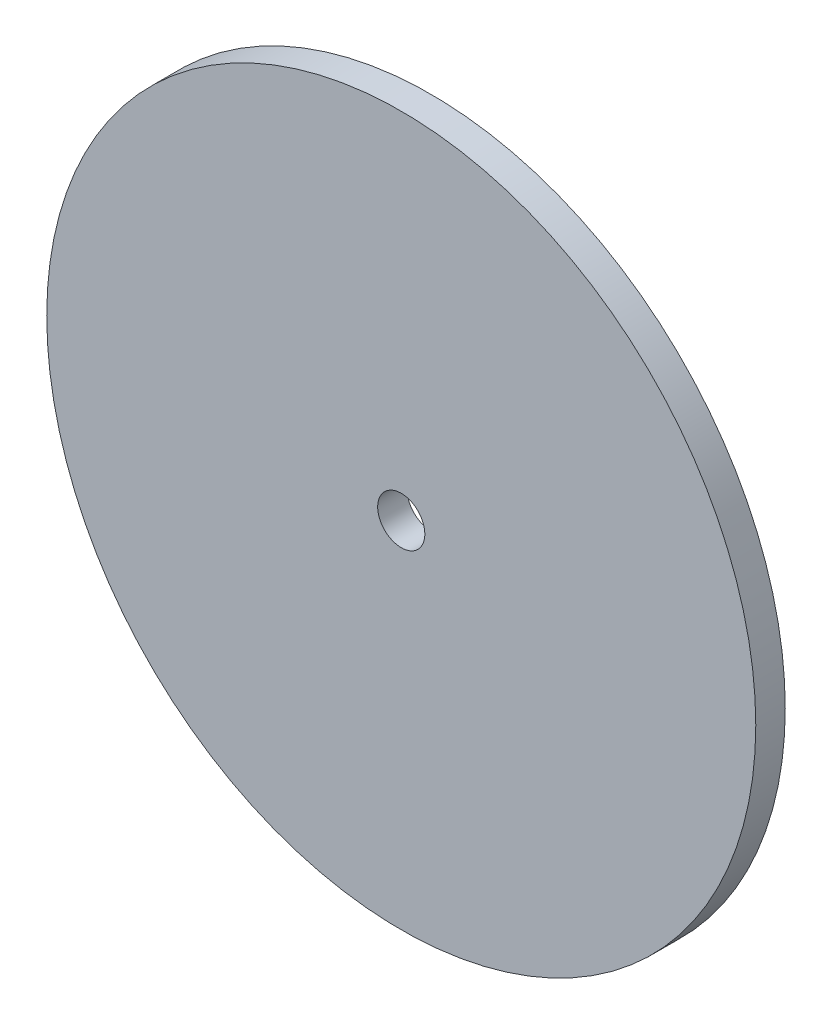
from build123d import *

# Parameters (mm, degrees)
SKETCH1_R           = 60.15
SKETCH1_R_2         = 4
BOSS_EXTRUDE2_DEPTH = 5


with BuildPart() as part:
    # Sketch1 → Boss-Extrude2 (new body)
    with BuildSketch(Plane.XY):
        Circle(SKETCH1_R)
        Circle(SKETCH1_R_2, mode=Mode.SUBTRACT)
    extrude(amount=BOSS_EXTRUDE2_DEPTH)


solid = part.part
